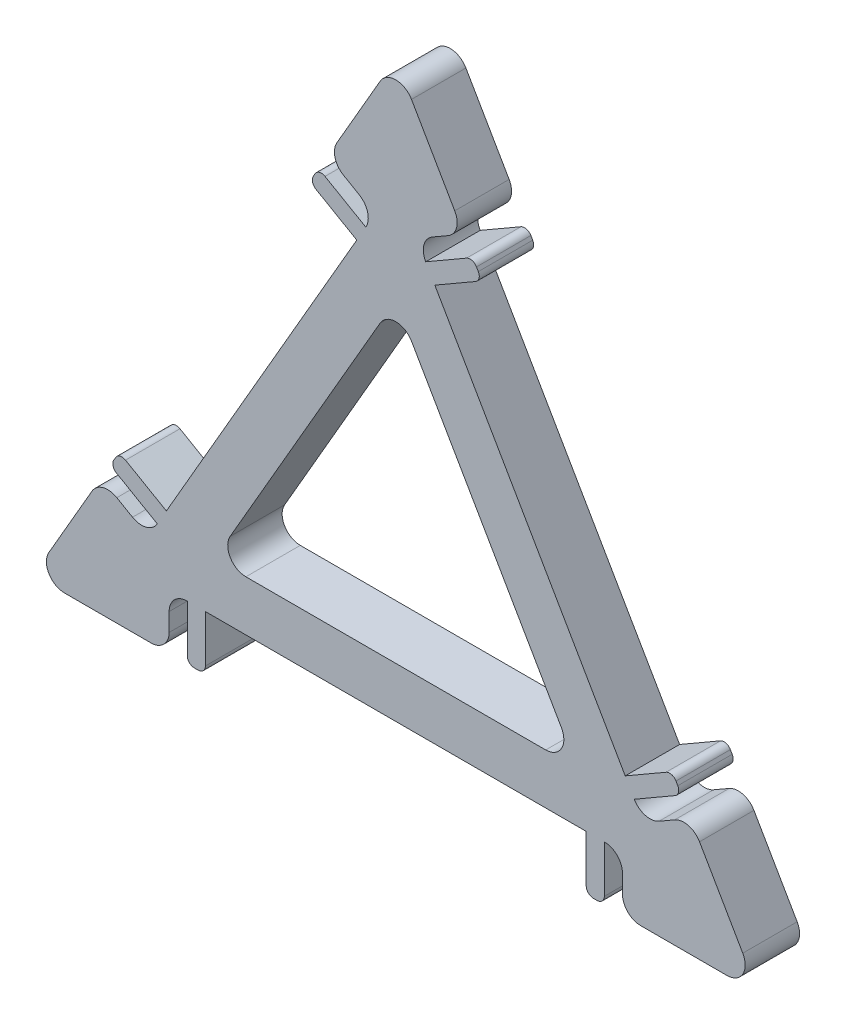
from build123d import *

# Parameters (mm, degrees)
BOSS_EXTRUDE1_DEPTH = 3
BOSS_EXTRUDE2_DEPTH = 3


with BuildPart() as part:
    # Sketch1 → Boss-Extrude1 (new body)
    with BuildSketch(Plane.XY):
        with BuildLine():
            Line((3.25, 17.464845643), (0.866025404, 21.594010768))
            ThreePointArc((0.866025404, 21.594010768), (0, 22.094010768), (-0.866025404, 21.594010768))
            Line((-0.866025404, 21.594010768), (-3.25, 17.464845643))
            ThreePointArc((-3.25, 17.464845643), (-3.349900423, 16.706026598), (-2.883974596, 16.098820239))
            Line((-2.883974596, 16.098820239), (-2.017949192, 15.598820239))
            ThreePointArc((-2.017949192, 15.598820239), (-1.552023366, 14.991613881), (-1.651923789, 14.232794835))
            Line((-1.651923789, 14.232794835), (-13.151923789, -5.685789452))
            ThreePointArc((-13.151923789, -5.685789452), (-13.759130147, -6.151715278), (-14.517949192, -6.051814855))
            Line((-14.517949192, -6.051814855), (-15.383974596, -5.551814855))
            ThreePointArc((-15.383974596, -5.551814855), (-16.142793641, -5.451914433), (-16.75, -5.917840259))
            Line((-16.75, -5.917840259), (-19.133974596, -10.047005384))
            ThreePointArc((-19.133974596, -10.047005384), (-19.133974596, -11.047005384), (-18.267949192, -11.547005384))
            Line((-18.267949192, -11.547005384), (-13.5, -11.547005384))
            ThreePointArc((-13.5, -11.547005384), (-12.792893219, -11.254112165), (-12.5, -10.547005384))
            Line((-12.5, -10.547005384), (-12.5, -9.547005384))
            ThreePointArc((-12.5, -9.547005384), (-12.207106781, -8.839898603), (-11.5, -8.547005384))
            Line((-11.5, -8.547005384), (11.5, -8.547005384))
            ThreePointArc((11.5, -8.547005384), (12.207106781, -8.839898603), (12.5, -9.547005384))
            Line((12.5, -9.547005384), (12.5, -10.547005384))
            ThreePointArc((12.5, -10.547005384), (12.792893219, -11.254112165), (13.5, -11.547005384))
            Line((13.5, -11.547005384), (18.267949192, -11.547005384))
            ThreePointArc((18.267949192, -11.547005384), (19.133974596, -11.047005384), (19.133974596, -10.047005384))
            Line((19.133974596, -10.047005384), (16.75, -5.917840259))
            ThreePointArc((16.75, -5.917840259), (16.142793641, -5.451914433), (15.383974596, -5.551814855))
            Line((15.383974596, -5.551814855), (14.517949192, -6.051814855))
            ThreePointArc((14.517949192, -6.051814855), (13.759130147, -6.151715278), (13.151923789, -5.685789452))
            Line((13.151923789, -5.685789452), (1.651923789, 14.232794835))
            ThreePointArc((1.651923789, 14.232794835), (1.552023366, 14.991613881), (2.017949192, 15.598820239))
            Line((2.017949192, 15.598820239), (2.883974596, 16.098820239))
            ThreePointArc((2.883974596, 16.098820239), (3.349900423, 16.706026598), (3.25, 17.464845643))
        make_face()
        with BuildLine():
            Line((-8.267949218, -5.771499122), (8.265954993, -5.774354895))
            ThreePointArc((8.265954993, -5.774354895), (9.132066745, -5.274504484), (9.132239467, -4.274504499))
            Line((9.132239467, -4.274504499), (0.867760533, 10.045704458))
            ThreePointArc((0.867760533, 10.045704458), (0.001821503, 10.545854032), (-0.864290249, 10.046003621))
            Line((-0.864290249, 10.046003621), (-9.133715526, -4.271349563))
            ThreePointArc((-9.133715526, -4.271349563), (-9.133888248, -5.271349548), (-8.267949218, -5.771499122))
        make_face(mode=Mode.SUBTRACT)
    extrude(amount=BOSS_EXTRUDE1_DEPTH)

    # Sketch2 → Boss-Extrude2 (add)
    with BuildSketch(Plane.XY.offset(3)):
        with BuildLine():
            Line((-10.5, -11.147005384), (-10.5, -8.547005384))
            Line((-10.5, -8.547005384), (-11.5, -8.547005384))
            Line((-11.5, -8.547005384), (-11.5, -11.147005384))
            ThreePointArc((-11.5, -11.147005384), (-11.382842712, -11.429848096), (-11.1, -11.547005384))
            Line((-11.1, -11.547005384), (-10.9, -11.547005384))
            ThreePointArc((-10.9, -11.547005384), (-10.617157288, -11.429848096), (-10.5, -11.147005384))
        make_face()
        with BuildLine():
            Line((-13.151923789, -5.685789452), (-12.651923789, -4.819764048))
            Line((-12.651923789, -4.819764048), (-14.903589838, -3.519764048))
            ThreePointArc((-14.903589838, -3.519764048), (-15.207117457, -3.479803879), (-15.45, -3.666174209))
            Line((-15.45, -3.666174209), (-15.55, -3.83937929))
            ThreePointArc((-15.55, -3.83937929), (-15.589960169, -4.142906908), (-15.403589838, -4.385789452))
            Line((-15.403589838, -4.385789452), (-13.151923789, -5.685789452))
        make_face()
        with BuildLine():
            Line((1.651923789, 14.232794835), (2.151923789, 13.366769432))
            Line((2.151923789, 13.366769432), (4.403589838, 14.666769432))
            ThreePointArc((4.403589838, 14.666769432), (4.589960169, 14.909651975), (4.55, 15.213179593))
            Line((4.55, 15.213179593), (4.45, 15.386384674))
            ThreePointArc((4.45, 15.386384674), (4.207117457, 15.572755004), (3.903589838, 15.532794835))
            Line((3.903589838, 15.532794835), (1.651923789, 14.232794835))
        make_face()
        with BuildLine():
            Line((-2.151923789, 13.366769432), (-1.651923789, 14.232794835))
            Line((-1.651923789, 14.232794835), (-3.903589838, 15.532794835))
            ThreePointArc((-3.903589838, 15.532794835), (-4.207117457, 15.572755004), (-4.45, 15.386384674))
            Line((-4.45, 15.386384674), (-4.55, 15.213179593))
            ThreePointArc((-4.55, 15.213179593), (-4.589960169, 14.909651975), (-4.403589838, 14.666769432))
            Line((-4.403589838, 14.666769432), (-2.151923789, 13.366769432))
        make_face()
        with BuildLine():
            Line((14.903589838, -3.519764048), (12.651923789, -4.819764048))
            Line((12.651923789, -4.819764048), (13.151923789, -5.685789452))
            Line((13.151923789, -5.685789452), (15.403589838, -4.385789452))
            ThreePointArc((15.403589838, -4.385789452), (15.589960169, -4.142906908), (15.55, -3.83937929))
            Line((15.55, -3.83937929), (15.45, -3.666174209))
            ThreePointArc((15.45, -3.666174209), (15.207117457, -3.479803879), (14.903589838, -3.519764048))
        make_face()
        with BuildLine():
            Line((11.5, -8.547005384), (10.5, -8.547005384))
            Line((10.5, -8.547005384), (10.5, -11.147005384))
            ThreePointArc((10.5, -11.147005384), (10.617157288, -11.429848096), (10.9, -11.547005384))
            Line((10.9, -11.547005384), (11.1, -11.547005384))
            ThreePointArc((11.1, -11.547005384), (11.382842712, -11.429848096), (11.5, -11.147005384))
            Line((11.5, -11.147005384), (11.5, -8.547005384))
        make_face()
    extrude(amount=-BOSS_EXTRUDE2_DEPTH)


solid = part.part
